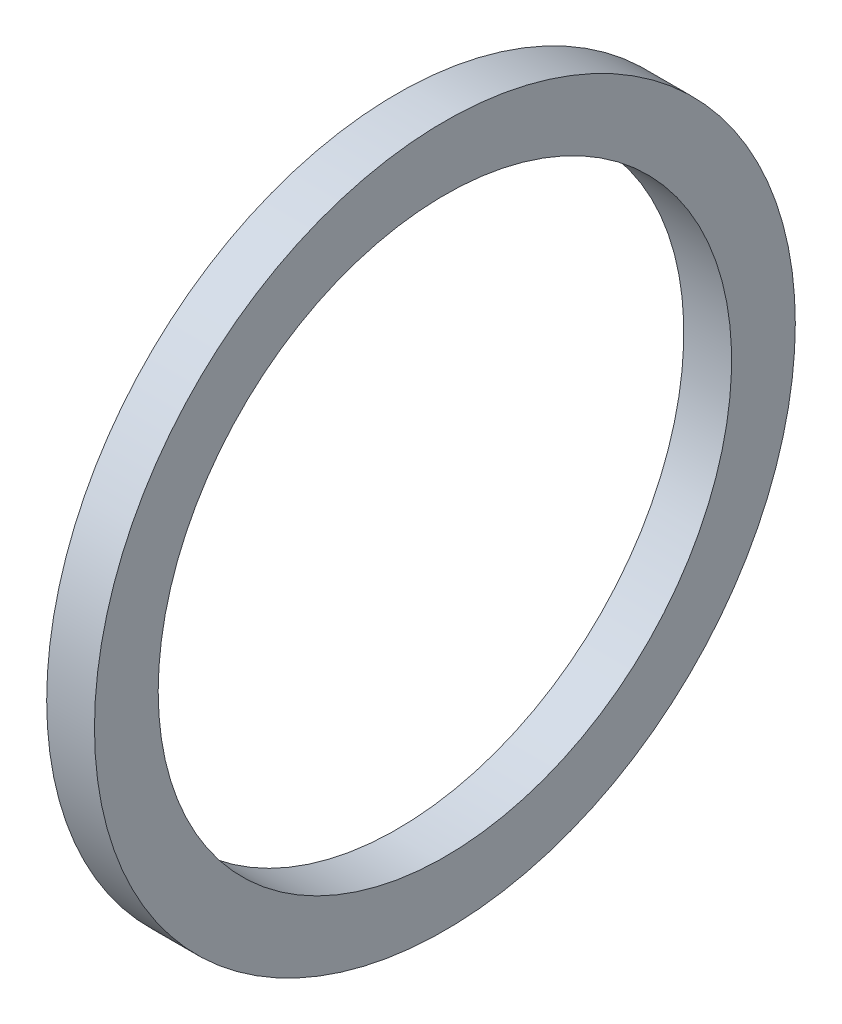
from build123d import *

# Parameters (mm, degrees)
ESQUISSE1_W = 3
ESQUISSE1_H = 4


with BuildPart() as part:
    # Esquisse1 → Base-R_volution (revolve)
    with BuildSketch(Plane(origin=(0, 0, 0), x_dir=(1, 0, 0), z_dir=(0, 1, 0)), mode=Mode.PRIVATE) as base_r_volution_sk:
        with Locations((1.5, 20)):
            Rectangle(ESQUISSE1_W, ESQUISSE1_H)
    revolve(base_r_volution_sk.sketch.rotate(Axis((0, 0, 0), (1, 0, 0)), 180), axis=Axis((0, 0, 0), (1, 0, 0)))


solid = part.part
